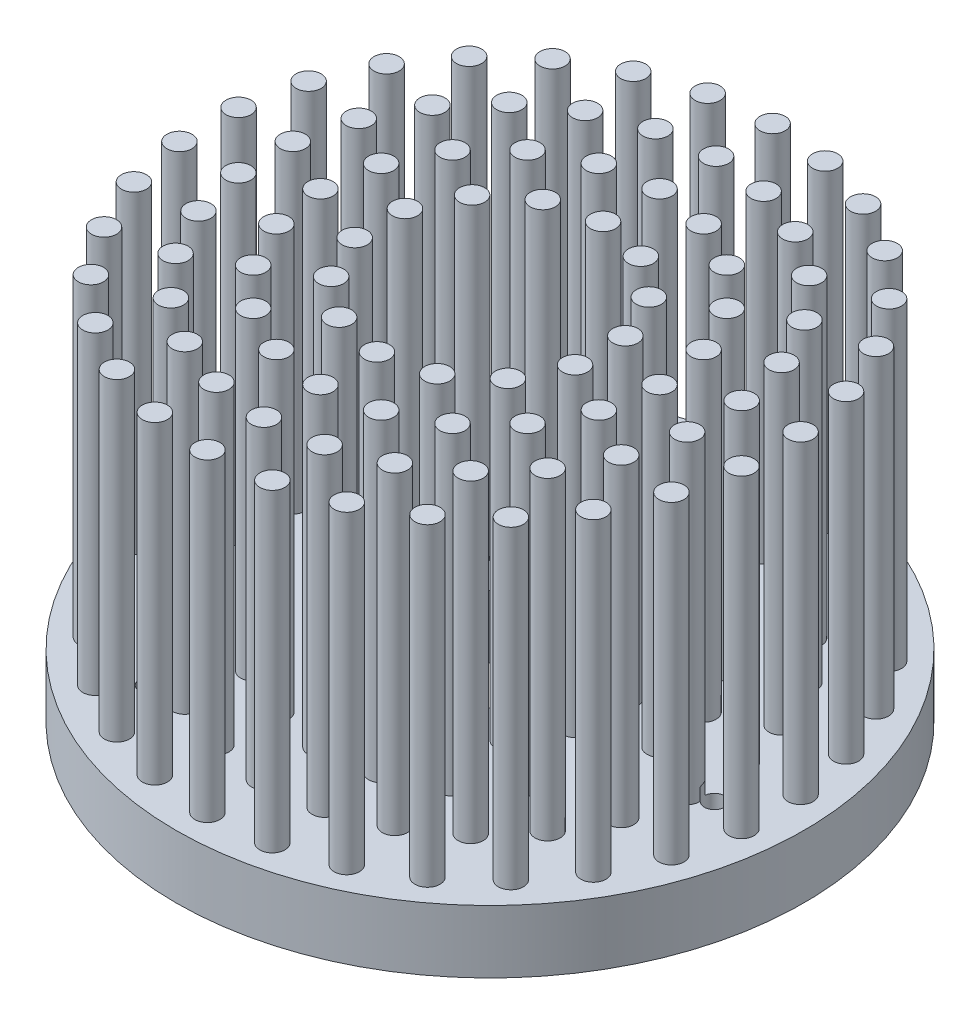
from build123d import *

# Parameters (mm, degrees)
SKETCH_1_R                = 25
EXTRUDE_1_DEPTH           = 3
SKETCH_2_R                = 1
EXTRUDE_2_DEPTH           = 27
SKETCH_5_R                = 25
EXTRUDE_5_DEPTH           = 2
M2X0_4_TAPPED_HOLE1_D     = 1.6
M2X0_4_TAPPED_HOLE1_DEPTH = 6
M2X0_4_TAPPED_HOLE1_TIP   = 0.480688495
SKETCH5_R                 = 5.75
EXTRUDE4_DEPTH            = 47.368092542


with BuildPart() as part:
    # Sketch 1 → Extrude 1 (new body)
    with BuildSketch(Plane(origin=(0, 0, 0), x_dir=(1, 0, 0), z_dir=(0, 1, 0))):
        with Locations(Location((0, 0, 0), (0, 0, 270))):
            Circle(SKETCH_1_R)
    extrude(amount=EXTRUDE_1_DEPTH)

    # Sketch 2 → Extrude 2 (add)
    with BuildSketch(Plane(origin=(0, 3, 0), x_dir=(1, 0, 0), z_dir=(0, 1, 0))):
        with Locations(Location((0, 0, 0), (0, 0, 270))):
            Circle(SKETCH_2_R)
        with Locations(Location((0, -4.5, 0), (0, 0, 270))):
            Circle(SKETCH_2_R)
        with Locations(Location((0, -9, 0), (0, 0, 270))):
            Circle(SKETCH_2_R)
        with Locations(Location((0, -13.5, 0), (0, 0, 270))):
            Circle(SKETCH_2_R)
        with Locations(Location((0, -18, 0), (0, 0, 270))):
            Circle(SKETCH_2_R)
        with Locations(Location((-4.307681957, -17.476952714, 0), (0, 0, 270))):
            Circle(SKETCH_2_R)
        with Locations(Location((-8.365017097, -15.938208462, 0), (0, 0, 270))):
            Circle(SKETCH_2_R)
        with Locations(Location((-11.936207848, -13.473193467, 0), (0, 0, 270))):
            Circle(SKETCH_2_R)
        with Locations(Location((-14.813709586, -10.225165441, 0), (0, 0, 270))):
            Circle(SKETCH_2_R)
        with Locations(Location((-16.830292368, -6.382887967, 0), (0, 0, 270))):
            Circle(SKETCH_2_R)
        with Locations(Location((-17.868759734, -2.169660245, 0), (0, 0, 270))):
            Circle(SKETCH_2_R)
        with Locations(Location((-17.868759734, 2.169660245, 0), (0, 0, 270))):
            Circle(SKETCH_2_R)
        with Locations(Location((-16.830292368, 6.382887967, 0), (0, 0, 270))):
            Circle(SKETCH_2_R)
        with Locations(Location((-14.813709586, 10.225165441, 0), (0, 0, 270))):
            Circle(SKETCH_2_R)
        with Locations(Location((-11.936207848, 13.473193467, 0), (0, 0, 270))):
            Circle(SKETCH_2_R)
        with Locations(Location((-8.365017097, 15.938208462, 0), (0, 0, 270))):
            Circle(SKETCH_2_R)
        with Locations(Location((-4.307681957, 17.476952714, 0), (0, 0, 270))):
            Circle(SKETCH_2_R)
        with Locations(Location((0, 18, 0), (0, 0, 270))):
            Circle(SKETCH_2_R)
        with Locations(Location((4.307681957, 17.476952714, 0), (0, 0, 270))):
            Circle(SKETCH_2_R)
        with Locations(Location((8.365017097, 15.938208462, 0), (0, 0, 270))):
            Circle(SKETCH_2_R)
        with Locations(Location((11.936207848, 13.473193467, 0), (0, 0, 270))):
            Circle(SKETCH_2_R)
        with Locations(Location((14.813709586, 10.225165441, 0), (0, 0, 270))):
            Circle(SKETCH_2_R)
        with Locations(Location((16.830292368, 6.382887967, 0), (0, 0, 270))):
            Circle(SKETCH_2_R)
        with Locations(Location((17.868759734, 2.169660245, 0), (0, 0, 270))):
            Circle(SKETCH_2_R)
        with Locations(Location((17.868759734, -2.169660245, 0), (0, 0, 270))):
            Circle(SKETCH_2_R)
        with Locations(Location((16.830292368, -6.382887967, 0), (0, 0, 270))):
            Circle(SKETCH_2_R)
        with Locations(Location((14.813709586, -10.225165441, 0), (0, 0, 270))):
            Circle(SKETCH_2_R)
        with Locations(Location((11.936207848, -13.473193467, 0), (0, 0, 270))):
            Circle(SKETCH_2_R)
        with Locations(Location((8.365017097, -15.938208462, 0), (0, 0, 270))):
            Circle(SKETCH_2_R)
        with Locations(Location((4.307681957, -17.476952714, 0), (0, 0, 270))):
            Circle(SKETCH_2_R)
        with Locations(Location((-4.171729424, -12.83926297, 0), (0, 0, 270))):
            Circle(SKETCH_2_R)
        with Locations(Location((-7.935100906, -10.921729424, 0), (0, 0, 270))):
            Circle(SKETCH_2_R)
        with Locations(Location((-10.921729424, -7.935100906, 0), (0, 0, 270))):
            Circle(SKETCH_2_R)
        with Locations(Location((-12.83926297, -4.171729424, 0), (0, 0, 270))):
            Circle(SKETCH_2_R)
        with Locations(Location((-13.5, 0, 0), (0, 0, 270))):
            Circle(SKETCH_2_R)
        with Locations(Location((-12.83926297, 4.171729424, 0), (0, 0, 270))):
            Circle(SKETCH_2_R)
        with Locations(Location((-10.921729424, 7.935100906, 0), (0, 0, 270))):
            Circle(SKETCH_2_R)
        with Locations(Location((-7.935100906, 10.921729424, 0), (0, 0, 270))):
            Circle(SKETCH_2_R)
        with Locations(Location((-4.171729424, 12.83926297, 0), (0, 0, 270))):
            Circle(SKETCH_2_R)
        with Locations(Location((0, 13.5, 0), (0, 0, 270))):
            Circle(SKETCH_2_R)
        with Locations(Location((4.171729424, 12.83926297, 0), (0, 0, 270))):
            Circle(SKETCH_2_R)
        with Locations(Location((7.935100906, 10.921729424, 0), (0, 0, 270))):
            Circle(SKETCH_2_R)
        with Locations(Location((10.921729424, 7.935100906, 0), (0, 0, 270))):
            Circle(SKETCH_2_R)
        with Locations(Location((12.83926297, 4.171729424, 0), (0, 0, 270))):
            Circle(SKETCH_2_R)
        with Locations(Location((13.5, 0, 0), (0, 0, 270))):
            Circle(SKETCH_2_R)
        with Locations(Location((12.83926297, -4.171729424, 0), (0, 0, 270))):
            Circle(SKETCH_2_R)
        with Locations(Location((10.921729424, -7.935100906, 0), (0, 0, 270))):
            Circle(SKETCH_2_R)
        with Locations(Location((7.935100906, -10.921729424, 0), (0, 0, 270))):
            Circle(SKETCH_2_R)
        with Locations(Location((4.171729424, -12.83926297, 0), (0, 0, 270))):
            Circle(SKETCH_2_R)
        with Locations(Location((-3.904953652, -8.108719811, 0), (0, 0, 270))):
            Circle(SKETCH_2_R)
        with Locations(Location((-7.036483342, -5.611408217, 0), (0, 0, 270))):
            Circle(SKETCH_2_R)
        with Locations(Location((-8.77435121, -2.002688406, 0), (0, 0, 270))):
            Circle(SKETCH_2_R)
        with Locations(Location((-8.77435121, 2.002688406, 0), (0, 0, 270))):
            Circle(SKETCH_2_R)
        with Locations(Location((-7.036483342, 5.611408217, 0), (0, 0, 270))):
            Circle(SKETCH_2_R)
        with Locations(Location((-3.904953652, 8.108719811, 0), (0, 0, 270))):
            Circle(SKETCH_2_R)
        with Locations(Location((0, 9, 0), (0, 0, 270))):
            Circle(SKETCH_2_R)
        with Locations(Location((3.904953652, 8.108719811, 0), (0, 0, 270))):
            Circle(SKETCH_2_R)
        with Locations(Location((7.036483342, 5.611408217, 0), (0, 0, 270))):
            Circle(SKETCH_2_R)
        with Locations(Location((8.77435121, 2.002688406, 0), (0, 0, 270))):
            Circle(SKETCH_2_R)
        with Locations(Location((8.77435121, -2.002688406, 0), (0, 0, 270))):
            Circle(SKETCH_2_R)
        with Locations(Location((7.036483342, -5.611408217, 0), (0, 0, 270))):
            Circle(SKETCH_2_R)
        with Locations(Location((3.904953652, -8.108719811, 0), (0, 0, 270))):
            Circle(SKETCH_2_R)
        with Locations(Location((-3.518241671, -2.805704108, 0), (0, 0, 270))):
            Circle(SKETCH_2_R)
        with Locations(Location((-4.387175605, 1.001344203, 0), (0, 0, 270))):
            Circle(SKETCH_2_R)
        with Locations(Location((-1.952476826, 4.054359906, 0), (0, 0, 270))):
            Circle(SKETCH_2_R)
        with Locations(Location((1.952476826, 4.054359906, 0), (0, 0, 270))):
            Circle(SKETCH_2_R)
        with Locations(Location((4.387175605, 1.001344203, 0), (0, 0, 270))):
            Circle(SKETCH_2_R)
        with Locations(Location((3.518241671, -2.805704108, 0), (0, 0, 270))):
            Circle(SKETCH_2_R)
        with Locations(Location((0, 22.5, 0), (0, 0, 270))):
            Circle(SKETCH_2_R)
        with Locations(Location((4.678013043, 22.008321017, 0), (0, 0, 270))):
            Circle(SKETCH_2_R)
        with Locations(Location((9.151574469, 20.554772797, 0), (0, 0, 270))):
            Circle(SKETCH_2_R)
        with Locations(Location((13.225168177, 18.202882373, 0), (0, 0, 270))):
            Circle(SKETCH_2_R)
        with Locations(Location((16.720758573, 15.055438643, 0), (0, 0, 270))):
            Circle(SKETCH_2_R)
        with Locations(Location((19.485571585, 11.25, 0), (0, 0, 270))):
            Circle(SKETCH_2_R)
        with Locations(Location((21.398771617, 6.952882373, 0), (0, 0, 270))):
            Circle(SKETCH_2_R)
        with Locations(Location((22.376742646, 2.351890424, 0), (0, 0, 270))):
            Circle(SKETCH_2_R)
        with Locations(Location((22.376742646, -2.351890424, 0), (0, 0, 270))):
            Circle(SKETCH_2_R)
        with Locations(Location((21.398771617, -6.952882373, 0), (0, 0, 270))):
            Circle(SKETCH_2_R)
        with Locations(Location((19.485571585, -11.25, 0), (0, 0, 270))):
            Circle(SKETCH_2_R)
        with Locations(Location((16.720758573, -15.055438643, 0), (0, 0, 270))):
            Circle(SKETCH_2_R)
        with Locations(Location((13.225168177, -18.202882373, 0), (0, 0, 270))):
            Circle(SKETCH_2_R)
        with Locations(Location((9.151574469, -20.554772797, 0), (0, 0, 270))):
            Circle(SKETCH_2_R)
        with Locations(Location((4.678013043, -22.008321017, 0), (0, 0, 270))):
            Circle(SKETCH_2_R)
        with Locations(Location((0, -22.5, 0), (0, 0, 270))):
            Circle(SKETCH_2_R)
        with Locations(Location((-4.678013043, -22.008321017, 0), (0, 0, 270))):
            Circle(SKETCH_2_R)
        with Locations(Location((-9.151574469, -20.554772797, 0), (0, 0, 270))):
            Circle(SKETCH_2_R)
        with Locations(Location((-13.225168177, -18.202882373, 0), (0, 0, 270))):
            Circle(SKETCH_2_R)
        with Locations(Location((-16.720758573, -15.055438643, 0), (0, 0, 270))):
            Circle(SKETCH_2_R)
        with Locations(Location((-19.485571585, -11.25, 0), (0, 0, 270))):
            Circle(SKETCH_2_R)
        with Locations(Location((-21.398771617, -6.952882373, 0), (0, 0, 270))):
            Circle(SKETCH_2_R)
        with Locations(Location((-22.376742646, -2.351890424, 0), (0, 0, 270))):
            Circle(SKETCH_2_R)
        with Locations(Location((-22.376742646, 2.351890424, 0), (0, 0, 270))):
            Circle(SKETCH_2_R)
        with Locations(Location((-21.398771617, 6.952882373, 0), (0, 0, 270))):
            Circle(SKETCH_2_R)
        with Locations(Location((-19.485571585, 11.25, 0), (0, 0, 270))):
            Circle(SKETCH_2_R)
        with Locations(Location((-16.720758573, 15.055438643, 0), (0, 0, 270))):
            Circle(SKETCH_2_R)
        with Locations(Location((-13.225168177, 18.202882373, 0), (0, 0, 270))):
            Circle(SKETCH_2_R)
        with Locations(Location((-9.151574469, 20.554772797, 0), (0, 0, 270))):
            Circle(SKETCH_2_R)
        with Locations(Location((-4.678013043, 22.008321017, 0), (0, 0, 270))):
            Circle(SKETCH_2_R)
    extrude(amount=EXTRUDE_2_DEPTH)

    # Sketch 5 → Extrude 5 (add)
    with BuildSketch(Plane(origin=(0, 3, 0), x_dir=(1, 0, 0), z_dir=(0, 1, 0))):
        with Locations(Location((0, 0, 0), (0, 0, 270))):
            Circle(SKETCH_5_R)
    extrude(amount=EXTRUDE_5_DEPTH)

    # M2x0.4 Tapped Hole1
    with Locations(Plane.XZ):
        with Locations((-11.077262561, 16.048185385), (19.436767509, 1.56909809), (-8.359504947, -17.617283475)):
            Hole(M2X0_4_TAPPED_HOLE1_D / 2, depth=M2X0_4_TAPPED_HOLE1_DEPTH)
            with Locations((0, 0, -(M2X0_4_TAPPED_HOLE1_DEPTH + M2X0_4_TAPPED_HOLE1_TIP / 2))):  # 118° drill point
                Cone(0, M2X0_4_TAPPED_HOLE1_D / 2, M2X0_4_TAPPED_HOLE1_TIP, mode=Mode.SUBTRACT)

    # Sketch5 → Extrude4 (cut, through all)
    with BuildSketch(Plane.XZ):
        with Locations(Location((0, 0, 0), (0, 0, 270))):
            Circle(SKETCH5_R)
    extrude(amount=-EXTRUDE4_DEPTH, mode=Mode.SUBTRACT)


solid = part.part
